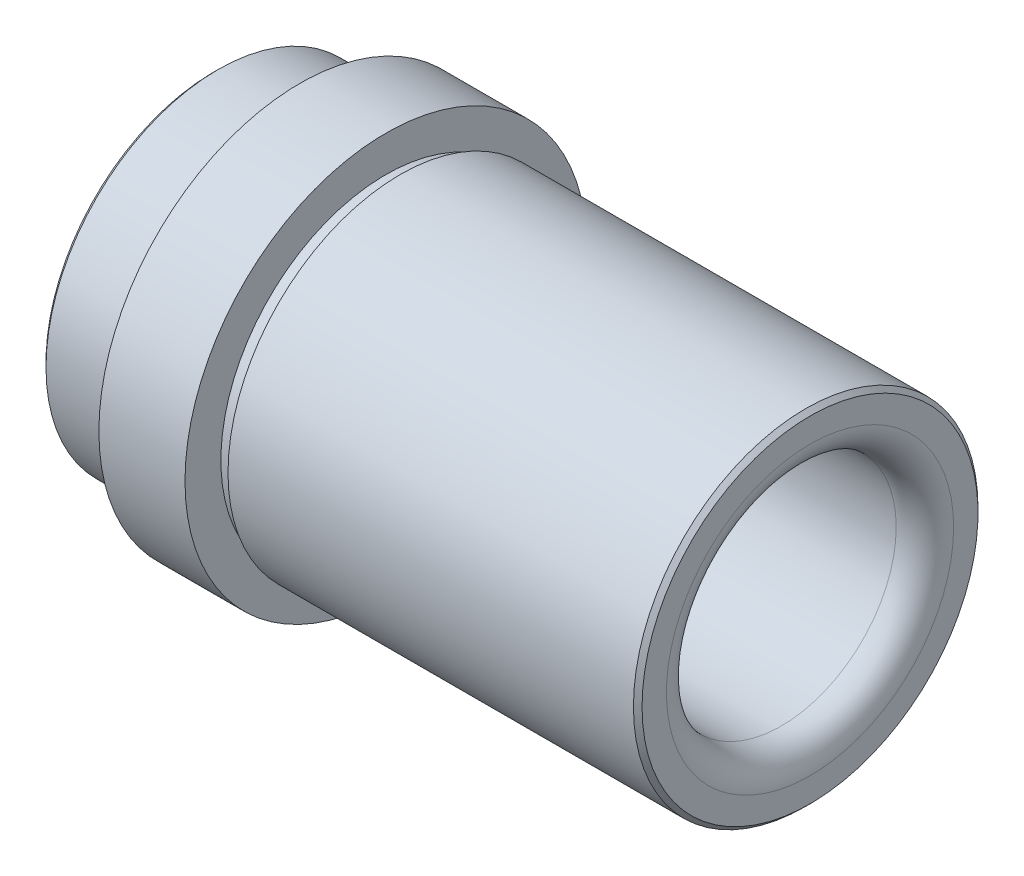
ISO-10303-21;
HEADER;
FILE_DESCRIPTION(('STEP AP214'),'2;1');
FILE_NAME('part.step','',(''),(''),'','','');
FILE_SCHEMA(('AUTOMOTIVE_DESIGN { 1 0 10303 214 1 1 1 1 }'));
ENDSEC;
DATA;
#1=APPLICATION_CONTEXT('core data for automotive mechanical design processes');
#2=APPLICATION_PROTOCOL_DEFINITION('international standard','automotive_design',2000,#1);
#3=PRODUCT_CONTEXT('',#1,'mechanical');
#4=PRODUCT('Part','Part','',(#3));
#5=PRODUCT_RELATED_PRODUCT_CATEGORY('part','',(#4));
#6=PRODUCT_DEFINITION_FORMATION('','',#4);
#7=PRODUCT_DEFINITION_CONTEXT('part definition',#1,'design');
#8=PRODUCT_DEFINITION('design','',#6,#7);
#9=PRODUCT_DEFINITION_SHAPE('','',#8);
#10=(LENGTH_UNIT() NAMED_UNIT(*) SI_UNIT(.MILLI.,.METRE.));
#11=(NAMED_UNIT(*) PLANE_ANGLE_UNIT() SI_UNIT($,.RADIAN.));
#12=(NAMED_UNIT(*) SI_UNIT($,.STERADIAN.) SOLID_ANGLE_UNIT());
#13=UNCERTAINTY_MEASURE_WITH_UNIT(LENGTH_MEASURE(1.E-05),#10,'distance_accuracy_value','');
#14=(GEOMETRIC_REPRESENTATION_CONTEXT(3) GLOBAL_UNCERTAINTY_ASSIGNED_CONTEXT((#13)) GLOBAL_UNIT_ASSIGNED_CONTEXT((#10,
#11,#12)) REPRESENTATION_CONTEXT('',''));
#15=CARTESIAN_POINT('',(0.,0.,0.));
#16=DIRECTION('',(0.,0.,1.));
#17=DIRECTION('',(1.,0.,0.));
#18=AXIS2_PLACEMENT_3D('',#15,#16,#17);
#19=CARTESIAN_POINT('',(2.65,0.,0.));
#20=DIRECTION('',(1.,0.,0.));
#21=DIRECTION('',(0.,0.,-1.));
#22=AXIS2_PLACEMENT_3D('',#19,#20,#21);
#23=CYLINDRICAL_SURFACE('',#22,11.98475);
#24=CARTESIAN_POINT('',(0.300000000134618,0.,0.));
#25=DIRECTION('',(1.,0.,0.));
#26=DIRECTION('',(0.,1.,0.));
#27=AXIS2_PLACEMENT_3D('',#24,#25,#26);
#28=CIRCLE('',#27,11.9847499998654);
#29=CARTESIAN_POINT('',(0.300000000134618,11.9847499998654,0.));
#30=VERTEX_POINT('',#29);
#31=EDGE_CURVE('E63',#30,#30,#28,.F.);
#32=ORIENTED_EDGE('',*,*,#31,.F.);
#33=EDGE_LOOP('',(#32));
#34=FACE_BOUND('',#33,.T.);
#35=CARTESIAN_POINT('',(5.,0.,0.));
#36=DIRECTION('',(1.,0.,0.));
#37=DIRECTION('',(0.,0.,-1.));
#38=AXIS2_PLACEMENT_3D('',#35,#36,#37);
#39=CIRCLE('',#38,11.98475);
#40=CARTESIAN_POINT('',(5.,0.,-11.98475));
#41=VERTEX_POINT('',#40);
#42=EDGE_CURVE('E18',#41,#41,#39,.T.);
#43=ORIENTED_EDGE('',*,*,#42,.F.);
#44=EDGE_LOOP('',(#43));
#45=FACE_BOUND('',#44,.T.);
#46=ADVANCED_FACE('F15',(#34,#45),#23,.T.);
#47=CARTESIAN_POINT('',(0.300000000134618,0.,0.));
#48=DIRECTION('',(1.,0.,0.));
#49=DIRECTION('',(0.,0.,-1.));
#50=AXIS2_PLACEMENT_3D('',#47,#48,#49);
#51=CONICAL_SURFACE('',#50,11.9847499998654,0.785398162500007);
#52=CARTESIAN_POINT('',(-1.3461535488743E-10,0.,0.));
#53=DIRECTION('',(1.,0.,0.));
#54=DIRECTION('',(0.,0.,-1.));
#55=AXIS2_PLACEMENT_3D('',#52,#53,#54);
#56=CIRCLE('',#55,11.6847500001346);
#57=CARTESIAN_POINT('',(-1.3461535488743E-10,0.,-11.6847500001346));
#58=VERTEX_POINT('',#57);
#59=EDGE_CURVE('E58',#58,#58,#56,.F.);
#60=ORIENTED_EDGE('',*,*,#59,.F.);
#61=EDGE_LOOP('',(#60));
#62=FACE_BOUND('',#61,.T.);
#63=ORIENTED_EDGE('',*,*,#31,.T.);
#64=EDGE_LOOP('',(#63));
#65=FACE_BOUND('',#64,.T.);
#66=ADVANCED_FACE('F131',(#62,#65),#51,.T.);
#67=CARTESIAN_POINT('',(5.,11.742375,0.));
#68=DIRECTION('',(1.,0.,0.));
#69=DIRECTION('',(0.,0.,-1.));
#70=AXIS2_PLACEMENT_3D('',#67,#68,#69);
#71=PLANE('',#70);
#72=CARTESIAN_POINT('',(5.,0.,0.));
#73=DIRECTION('',(1.,0.,0.));
#74=DIRECTION('',(0.,0.,-1.));
#75=AXIS2_PLACEMENT_3D('',#72,#73,#74);
#76=CIRCLE('',#75,11.5);
#77=CARTESIAN_POINT('',(5.,0.,-11.5));
#78=VERTEX_POINT('',#77);
#79=EDGE_CURVE('E56',#78,#78,#76,.T.);
#80=ORIENTED_EDGE('',*,*,#79,.F.);
#81=EDGE_LOOP('',(#80));
#82=FACE_BOUND('',#81,.T.);
#83=ORIENTED_EDGE('',*,*,#42,.T.);
#84=EDGE_LOOP('',(#83));
#85=FACE_BOUND('',#84,.T.);
#86=ADVANCED_FACE('F122',(#82,#85),#71,.T.);
#87=CARTESIAN_POINT('',(0.,10.094625,0.));
#88=DIRECTION('',(-1.,0.,0.));
#89=DIRECTION('',(0.,0.,1.));
#90=AXIS2_PLACEMENT_3D('',#87,#88,#89);
#91=PLANE('',#90);
#92=CARTESIAN_POINT('',(-2.24362466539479E-10,0.,0.));
#93=DIRECTION('',(-1.,0.,0.));
#94=DIRECTION('',(0.,0.,1.));
#95=AXIS2_PLACEMENT_3D('',#92,#93,#94);
#96=CIRCLE('',#95,8.50449999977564);
#97=CARTESIAN_POINT('',(-2.24362466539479E-10,0.,8.50449999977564));
#98=VERTEX_POINT('',#97);
#99=EDGE_CURVE('E53',#98,#98,#96,.F.);
#100=ORIENTED_EDGE('',*,*,#99,.T.);
#101=EDGE_LOOP('',(#100));
#102=FACE_BOUND('',#101,.T.);
#103=ORIENTED_EDGE('',*,*,#59,.T.);
#104=EDGE_LOOP('',(#103));
#105=FACE_BOUND('',#104,.T.);
#106=ADVANCED_FACE('F120',(#102,#105),#91,.T.);
#107=CARTESIAN_POINT('',(5.5,0.,0.));
#108=DIRECTION('',(1.,0.,0.));
#109=DIRECTION('',(0.,0.,-1.));
#110=AXIS2_PLACEMENT_3D('',#107,#108,#109);
#111=CYLINDRICAL_SURFACE('',#110,11.5);
#112=ORIENTED_EDGE('',*,*,#79,.T.);
#113=EDGE_LOOP('',(#112));
#114=FACE_BOUND('',#113,.T.);
#115=CARTESIAN_POINT('',(6.,0.,0.));
#116=DIRECTION('',(1.,0.,0.));
#117=DIRECTION('',(0.,0.,-1.));
#118=AXIS2_PLACEMENT_3D('',#115,#116,#117);
#119=CIRCLE('',#118,11.5);
#120=CARTESIAN_POINT('',(6.,0.,-11.5));
#121=VERTEX_POINT('',#120);
#122=EDGE_CURVE('E50',#121,#121,#119,.T.);
#123=ORIENTED_EDGE('',*,*,#122,.F.);
#124=EDGE_LOOP('',(#123));
#125=FACE_BOUND('',#124,.T.);
#126=ADVANCED_FACE('F116',(#114,#125),#111,.T.);
#127=CARTESIAN_POINT('',(-2.2436203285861E-10,0.,0.));
#128=DIRECTION('',(-1.,0.,0.));
#129=DIRECTION('',(0.,0.,1.));
#130=AXIS2_PLACEMENT_3D('',#127,#128,#129);
#131=CONICAL_SURFACE('',#130,8.50449999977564,0.7853981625);
#132=CARTESIAN_POINT('',(0.5,0.,0.));
#133=DIRECTION('',(1.,0.,0.));
#134=DIRECTION('',(0.,0.,-1.));
#135=AXIS2_PLACEMENT_3D('',#132,#133,#134);
#136=CIRCLE('',#135,8.0045);
#137=CARTESIAN_POINT('',(0.5,0.,-8.0045));
#138=VERTEX_POINT('',#137);
#139=EDGE_CURVE('E49',#138,#138,#136,.T.);
#140=ORIENTED_EDGE('',*,*,#139,.T.);
#141=EDGE_LOOP('',(#140));
#142=FACE_BOUND('',#141,.T.);
#143=ORIENTED_EDGE('',*,*,#99,.F.);
#144=EDGE_LOOP('',(#143));
#145=FACE_BOUND('',#144,.T.);
#146=ADVANCED_FACE('F113',(#142,#145),#131,.F.);
#147=CARTESIAN_POINT('',(6.,12.992375,0.));
#148=DIRECTION('',(-1.,0.,0.));
#149=DIRECTION('',(0.,0.,1.));
#150=AXIS2_PLACEMENT_3D('',#147,#148,#149);
#151=PLANE('',#150);
#152=ORIENTED_EDGE('',*,*,#122,.T.);
#153=EDGE_LOOP('',(#152));
#154=FACE_BOUND('',#153,.T.);
#155=CARTESIAN_POINT('',(6.,0.,0.));
#156=DIRECTION('',(1.,0.,0.));
#157=DIRECTION('',(0.,0.,-1.));
#158=AXIS2_PLACEMENT_3D('',#155,#156,#157);
#159=CIRCLE('',#158,14.);
#160=CARTESIAN_POINT('',(6.,0.,-14.));
#161=VERTEX_POINT('',#160);
#162=EDGE_CURVE('E46',#161,#161,#159,.T.);
#163=ORIENTED_EDGE('',*,*,#162,.F.);
#164=EDGE_LOOP('',(#163));
#165=FACE_BOUND('',#164,.T.);
#166=ADVANCED_FACE('F110',(#154,#165),#151,.T.);
#167=CARTESIAN_POINT('',(20.025,0.,0.));
#168=DIRECTION('',(1.,0.,0.));
#169=DIRECTION('',(0.,0.,-1.));
#170=AXIS2_PLACEMENT_3D('',#167,#168,#169);
#171=CYLINDRICAL_SURFACE('',#170,8.0045);
#172=CARTESIAN_POINT('',(39.55,0.,0.));
#173=DIRECTION('',(1.,0.,0.));
#174=DIRECTION('',(0.,0.,-1.));
#175=AXIS2_PLACEMENT_3D('',#172,#173,#174);
#176=CIRCLE('',#175,8.00449999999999);
#177=CARTESIAN_POINT('',(39.55,0.,-8.00449999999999));
#178=VERTEX_POINT('',#177);
#179=EDGE_CURVE('E45',#178,#178,#176,.F.);
#180=ORIENTED_EDGE('',*,*,#179,.F.);
#181=EDGE_LOOP('',(#180));
#182=FACE_BOUND('',#181,.T.);
#183=ORIENTED_EDGE('',*,*,#139,.F.);
#184=EDGE_LOOP('',(#183));
#185=FACE_BOUND('',#184,.T.);
#186=ADVANCED_FACE('F107',(#182,#185),#171,.F.);
#187=CARTESIAN_POINT('',(9.,0.,0.));
#188=DIRECTION('',(1.,0.,0.));
#189=DIRECTION('',(0.,0.,-1.));
#190=AXIS2_PLACEMENT_3D('',#187,#188,#189);
#191=CYLINDRICAL_SURFACE('',#190,14.);
#192=ORIENTED_EDGE('',*,*,#162,.T.);
#193=EDGE_LOOP('',(#192));
#194=FACE_BOUND('',#193,.T.);
#195=CARTESIAN_POINT('',(12.,0.,0.));
#196=DIRECTION('',(1.,0.,0.));
#197=DIRECTION('',(0.,0.,-1.));
#198=AXIS2_PLACEMENT_3D('',#195,#196,#197);
#199=CIRCLE('',#198,14.);
#200=CARTESIAN_POINT('',(12.,0.,-14.));
#201=VERTEX_POINT('',#200);
#202=EDGE_CURVE('E42',#201,#201,#199,.T.);
#203=ORIENTED_EDGE('',*,*,#202,.F.);
#204=EDGE_LOOP('',(#203));
#205=FACE_BOUND('',#204,.T.);
#206=ADVANCED_FACE('F92',(#194,#205),#191,.T.);
#207=CARTESIAN_POINT('',(39.55,0.,0.));
#208=DIRECTION('',(1.,0.,0.));
#209=DIRECTION('',(0.,0.,-1.));
#210=AXIS2_PLACEMENT_3D('',#207,#208,#209);
#211=TOROIDAL_SURFACE('',#210,10.0045,2.00000000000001);
#212=CARTESIAN_POINT('',(41.55,0.,0.));
#213=DIRECTION('',(1.,0.,0.));
#214=DIRECTION('',(0.,1.,0.));
#215=AXIS2_PLACEMENT_3D('',#212,#213,#214);
#216=CIRCLE('',#215,10.0045);
#217=CARTESIAN_POINT('',(41.55,10.0045,0.));
#218=VERTEX_POINT('',#217);
#219=EDGE_CURVE('E41',#218,#218,#216,.F.);
#220=ORIENTED_EDGE('',*,*,#219,.F.);
#221=EDGE_LOOP('',(#220));
#222=FACE_BOUND('',#221,.T.);
#223=ORIENTED_EDGE('',*,*,#179,.T.);
#224=EDGE_LOOP('',(#223));
#225=FACE_BOUND('',#224,.T.);
#226=ADVANCED_FACE('F80',(#222,#225),#211,.T.);
#227=CARTESIAN_POINT('',(12.,12.75,0.));
#228=DIRECTION('',(1.,0.,0.));
#229=DIRECTION('',(0.,0.,-1.));
#230=AXIS2_PLACEMENT_3D('',#227,#228,#229);
#231=PLANE('',#230);
#232=CARTESIAN_POINT('',(12.,0.,0.));
#233=DIRECTION('',(1.,0.,0.));
#234=DIRECTION('',(0.,0.,-1.));
#235=AXIS2_PLACEMENT_3D('',#232,#233,#234);
#236=CIRCLE('',#235,11.5);
#237=CARTESIAN_POINT('',(12.,0.,-11.5));
#238=VERTEX_POINT('',#237);
#239=EDGE_CURVE('E38',#238,#238,#236,.T.);
#240=ORIENTED_EDGE('',*,*,#239,.F.);
#241=EDGE_LOOP('',(#240));
#242=FACE_BOUND('',#241,.T.);
#243=ORIENTED_EDGE('',*,*,#202,.T.);
#244=EDGE_LOOP('',(#243));
#245=FACE_BOUND('',#244,.T.);
#246=ADVANCED_FACE('F91',(#242,#245),#231,.T.);
#247=CARTESIAN_POINT('',(41.55,10.854375,0.));
#248=DIRECTION('',(1.,0.,0.));
#249=DIRECTION('',(0.,0.,-1.));
#250=AXIS2_PLACEMENT_3D('',#247,#248,#249);
#251=PLANE('',#250);
#252=ORIENTED_EDGE('',*,*,#219,.T.);
#253=EDGE_LOOP('',(#252));
#254=FACE_BOUND('',#253,.T.);
#255=CARTESIAN_POINT('',(41.5500000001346,0.,0.));
#256=DIRECTION('',(-1.,0.,0.));
#257=DIRECTION('',(0.,0.,1.));
#258=AXIS2_PLACEMENT_3D('',#255,#256,#257);
#259=CIRCLE('',#258,11.7042500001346);
#260=CARTESIAN_POINT('',(41.5500000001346,0.,11.7042500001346));
#261=VERTEX_POINT('',#260);
#262=EDGE_CURVE('E35',#261,#261,#259,.T.);
#263=ORIENTED_EDGE('',*,*,#262,.F.);
#264=EDGE_LOOP('',(#263));
#265=FACE_BOUND('',#264,.T.);
#266=ADVANCED_FACE('F151',(#254,#265),#251,.T.);
#267=CARTESIAN_POINT('',(12.5,0.,0.));
#268=DIRECTION('',(1.,0.,0.));
#269=DIRECTION('',(0.,0.,-1.));
#270=AXIS2_PLACEMENT_3D('',#267,#268,#269);
#271=CYLINDRICAL_SURFACE('',#270,11.5);
#272=ORIENTED_EDGE('',*,*,#239,.T.);
#273=EDGE_LOOP('',(#272));
#274=FACE_BOUND('',#273,.T.);
#275=CARTESIAN_POINT('',(13.,0.,0.));
#276=DIRECTION('',(1.,0.,0.));
#277=DIRECTION('',(0.,0.,-1.));
#278=AXIS2_PLACEMENT_3D('',#275,#276,#277);
#279=CIRCLE('',#278,11.5);
#280=CARTESIAN_POINT('',(13.,0.,-11.5));
#281=VERTEX_POINT('',#280);
#282=EDGE_CURVE('E27',#281,#281,#279,.T.);
#283=ORIENTED_EDGE('',*,*,#282,.F.);
#284=EDGE_LOOP('',(#283));
#285=FACE_BOUND('',#284,.T.);
#286=ADVANCED_FACE('F148',(#274,#285),#271,.T.);
#287=CARTESIAN_POINT('',(41.2499999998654,0.,0.));
#288=DIRECTION('',(-1.,0.,0.));
#289=DIRECTION('',(0.,0.,1.));
#290=AXIS2_PLACEMENT_3D('',#287,#288,#289);
#291=CONICAL_SURFACE('',#290,12.0042499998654,0.785398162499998);
#292=CARTESIAN_POINT('',(41.25,0.,0.));
#293=DIRECTION('',(1.,0.,0.));
#294=DIRECTION('',(0.,0.,-1.));
#295=AXIS2_PLACEMENT_3D('',#292,#293,#294);
#296=CIRCLE('',#295,12.00425);
#297=CARTESIAN_POINT('',(41.25,0.,-12.00425));
#298=VERTEX_POINT('',#297);
#299=EDGE_CURVE('E22',#298,#298,#296,.F.);
#300=ORIENTED_EDGE('',*,*,#299,.F.);
#301=EDGE_LOOP('',(#300));
#302=FACE_BOUND('',#301,.T.);
#303=ORIENTED_EDGE('',*,*,#262,.T.);
#304=EDGE_LOOP('',(#303));
#305=FACE_BOUND('',#304,.T.);
#306=ADVANCED_FACE('F141',(#302,#305),#291,.T.);
#307=CARTESIAN_POINT('',(13.,11.752125,0.));
#308=DIRECTION('',(-1.,0.,0.));
#309=DIRECTION('',(0.,0.,1.));
#310=AXIS2_PLACEMENT_3D('',#307,#308,#309);
#311=PLANE('',#310);
#312=ORIENTED_EDGE('',*,*,#282,.T.);
#313=EDGE_LOOP('',(#312));
#314=FACE_BOUND('',#313,.T.);
#315=CARTESIAN_POINT('',(13.,0.,0.));
#316=DIRECTION('',(1.,0.,0.));
#317=DIRECTION('',(0.,0.,-1.));
#318=AXIS2_PLACEMENT_3D('',#315,#316,#317);
#319=CIRCLE('',#318,12.00425);
#320=CARTESIAN_POINT('',(13.,0.,-12.00425));
#321=VERTEX_POINT('',#320);
#322=EDGE_CURVE('E10',#321,#321,#319,.T.);
#323=ORIENTED_EDGE('',*,*,#322,.F.);
#324=EDGE_LOOP('',(#323));
#325=FACE_BOUND('',#324,.T.);
#326=ADVANCED_FACE('F136',(#314,#325),#311,.T.);
#327=CARTESIAN_POINT('',(27.125,0.,0.));
#328=DIRECTION('',(1.,0.,0.));
#329=DIRECTION('',(0.,0.,-1.));
#330=AXIS2_PLACEMENT_3D('',#327,#328,#329);
#331=CYLINDRICAL_SURFACE('',#330,12.00425);
#332=ORIENTED_EDGE('',*,*,#322,.T.);
#333=EDGE_LOOP('',(#332));
#334=FACE_BOUND('',#333,.T.);
#335=ORIENTED_EDGE('',*,*,#299,.T.);
#336=EDGE_LOOP('',(#335));
#337=FACE_BOUND('',#336,.T.);
#338=ADVANCED_FACE('F134',(#334,#337),#331,.T.);
#339=CLOSED_SHELL('',(#46,#66,#86,#106,#126,#146,#166,#186,#206,#226,#246,#266,#286,#306,#326,#338));
#340=MANIFOLD_SOLID_BREP('B1',#339);
#341=ADVANCED_BREP_SHAPE_REPRESENTATION('',(#18,#340),#14);
#342=SHAPE_DEFINITION_REPRESENTATION(#9,#341);
ENDSEC;
END-ISO-10303-21;
